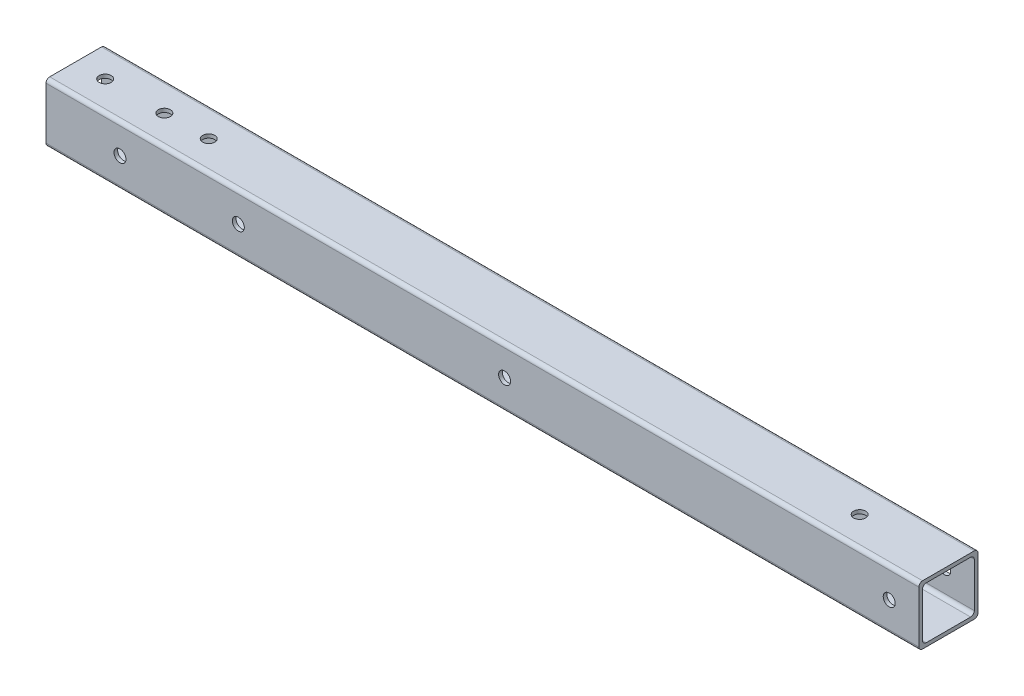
ISO-10303-21;
HEADER;
FILE_DESCRIPTION(('STEP AP214'),'2;1');
FILE_NAME('part.step','',(''),(''),'','','');
FILE_SCHEMA(('AUTOMOTIVE_DESIGN { 1 0 10303 214 1 1 1 1 }'));
ENDSEC;
DATA;
#1=APPLICATION_CONTEXT('core data for automotive mechanical design processes');
#2=APPLICATION_PROTOCOL_DEFINITION('international standard','automotive_design',2000,#1);
#3=PRODUCT_CONTEXT('',#1,'mechanical');
#4=PRODUCT('Part','Part','',(#3));
#5=PRODUCT_RELATED_PRODUCT_CATEGORY('part','',(#4));
#6=PRODUCT_DEFINITION_FORMATION('','',#4);
#7=PRODUCT_DEFINITION_CONTEXT('part definition',#1,'design');
#8=PRODUCT_DEFINITION('design','',#6,#7);
#9=PRODUCT_DEFINITION_SHAPE('','',#8);
#10=(LENGTH_UNIT() NAMED_UNIT(*) SI_UNIT(.MILLI.,.METRE.));
#11=(NAMED_UNIT(*) PLANE_ANGLE_UNIT() SI_UNIT($,.RADIAN.));
#12=(NAMED_UNIT(*) SI_UNIT($,.STERADIAN.) SOLID_ANGLE_UNIT());
#13=UNCERTAINTY_MEASURE_WITH_UNIT(LENGTH_MEASURE(1.E-05),#10,'distance_accuracy_value','');
#14=(GEOMETRIC_REPRESENTATION_CONTEXT(3) GLOBAL_UNCERTAINTY_ASSIGNED_CONTEXT((#13)) GLOBAL_UNIT_ASSIGNED_CONTEXT((#10,
#11,#12)) REPRESENTATION_CONTEXT('',''));
#15=CARTESIAN_POINT('',(0.,0.,0.));
#16=DIRECTION('',(0.,0.,1.));
#17=DIRECTION('',(1.,0.,0.));
#18=AXIS2_PLACEMENT_3D('',#15,#16,#17);
#19=CARTESIAN_POINT('',(0.,101.6,0.));
#20=DIRECTION('',(-1.,0.,0.));
#21=DIRECTION('',(0.,0.,1.));
#22=AXIS2_PLACEMENT_3D('',#19,#20,#21);
#23=PLANE('',#22);
#24=DIRECTION('',(0.,0.,1.));
#25=VECTOR('',#24,1.);
#26=CARTESIAN_POINT('',(0.,95.25,6.35000000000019));
#27=LINE('',#26,#25);
#28=CARTESIAN_POINT('',(0.,95.25,12.7000000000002));
#29=VERTEX_POINT('',#28);
#30=CARTESIAN_POINT('',(0.,95.25,88.9000000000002));
#31=VERTEX_POINT('',#30);
#32=EDGE_CURVE('E169',#29,#31,#27,.T.);
#33=ORIENTED_EDGE('',*,*,#32,.F.);
#34=CARTESIAN_POINT('',(0.,88.9,12.7000000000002));
#35=DIRECTION('',(-1.,0.,0.));
#36=DIRECTION('',(0.,0.,1.));
#37=AXIS2_PLACEMENT_3D('',#34,#35,#36);
#38=CIRCLE('',#37,6.35);
#39=CARTESIAN_POINT('',(0.,88.9,6.35000000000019));
#40=VERTEX_POINT('',#39);
#41=EDGE_CURVE('E179',#29,#40,#38,.T.);
#42=ORIENTED_EDGE('',*,*,#41,.T.);
#43=DIRECTION('',(0.,1.,0.));
#44=VECTOR('',#43,1.);
#45=CARTESIAN_POINT('',(0.,95.25,6.35000000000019));
#46=LINE('',#45,#44);
#47=CARTESIAN_POINT('',(0.,12.7,6.3500000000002));
#48=VERTEX_POINT('',#47);
#49=EDGE_CURVE('E276',#48,#40,#46,.T.);
#50=ORIENTED_EDGE('',*,*,#49,.F.);
#51=CARTESIAN_POINT('',(0.,12.7,12.7000000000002));
#52=DIRECTION('',(-1.,0.,0.));
#53=DIRECTION('',(0.,0.,1.));
#54=AXIS2_PLACEMENT_3D('',#51,#52,#53);
#55=CIRCLE('',#54,6.35);
#56=CARTESIAN_POINT('',(0.,6.35,12.7000000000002));
#57=VERTEX_POINT('',#56);
#58=EDGE_CURVE('E11',#48,#57,#55,.T.);
#59=ORIENTED_EDGE('',*,*,#58,.T.);
#60=DIRECTION('',(0.,0.,-1.));
#61=VECTOR('',#60,1.);
#62=CARTESIAN_POINT('',(0.,6.35,6.35000000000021));
#63=LINE('',#62,#61);
#64=CARTESIAN_POINT('',(0.,6.35,88.9000000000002));
#65=VERTEX_POINT('',#64);
#66=EDGE_CURVE('E289',#65,#57,#63,.T.);
#67=ORIENTED_EDGE('',*,*,#66,.F.);
#68=CARTESIAN_POINT('',(0.,12.7,88.9000000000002));
#69=DIRECTION('',(-1.,0.,0.));
#70=DIRECTION('',(0.,0.,1.));
#71=AXIS2_PLACEMENT_3D('',#68,#69,#70);
#72=CIRCLE('',#71,6.35);
#73=CARTESIAN_POINT('',(0.,12.7,95.2500000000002));
#74=VERTEX_POINT('',#73);
#75=EDGE_CURVE('E168',#65,#74,#72,.T.);
#76=ORIENTED_EDGE('',*,*,#75,.T.);
#77=DIRECTION('',(0.,-1.,0.));
#78=VECTOR('',#77,1.);
#79=CARTESIAN_POINT('',(0.,95.25,95.2500000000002));
#80=LINE('',#79,#78);
#81=CARTESIAN_POINT('',(0.,88.9,95.2500000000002));
#82=VERTEX_POINT('',#81);
#83=EDGE_CURVE('E152',#82,#74,#80,.T.);
#84=ORIENTED_EDGE('',*,*,#83,.F.);
#85=CARTESIAN_POINT('',(0.,88.9,88.9000000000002));
#86=DIRECTION('',(-1.,0.,0.));
#87=DIRECTION('',(0.,0.,1.));
#88=AXIS2_PLACEMENT_3D('',#85,#86,#87);
#89=CIRCLE('',#88,6.35);
#90=EDGE_CURVE('E164',#82,#31,#89,.T.);
#91=ORIENTED_EDGE('',*,*,#90,.T.);
#92=EDGE_LOOP('',(#33,#42,#50,#59,#67,#76,#84,#91));
#93=FACE_BOUND('',#92,.T.);
#94=DIRECTION('',(0.,-1.,0.));
#95=VECTOR('',#94,1.);
#96=CARTESIAN_POINT('',(0.,101.6,101.6));
#97=LINE('',#96,#95);
#98=CARTESIAN_POINT('',(0.,95.25,101.6));
#99=VERTEX_POINT('',#98);
#100=CARTESIAN_POINT('',(0.,6.34999999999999,101.6));
#101=VERTEX_POINT('',#100);
#102=EDGE_CURVE('E300',#99,#101,#97,.T.);
#103=ORIENTED_EDGE('',*,*,#102,.T.);
#104=CARTESIAN_POINT('',(0.,6.34999999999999,95.25));
#105=DIRECTION('',(-1.,0.,0.));
#106=DIRECTION('',(0.,0.,1.));
#107=AXIS2_PLACEMENT_3D('',#104,#105,#106);
#108=CIRCLE('',#107,6.35);
#109=CARTESIAN_POINT('',(0.,0.,95.25));
#110=VERTEX_POINT('',#109);
#111=EDGE_CURVE('E331',#101,#110,#108,.F.);
#112=ORIENTED_EDGE('',*,*,#111,.T.);
#113=DIRECTION('',(0.,0.,-1.));
#114=VECTOR('',#113,1.);
#115=CARTESIAN_POINT('',(0.,0.,0.));
#116=LINE('',#115,#114);
#117=CARTESIAN_POINT('',(0.,0.,6.35));
#118=VERTEX_POINT('',#117);
#119=EDGE_CURVE('E292',#110,#118,#116,.T.);
#120=ORIENTED_EDGE('',*,*,#119,.T.);
#121=CARTESIAN_POINT('',(0.,6.34999999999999,6.35));
#122=DIRECTION('',(-1.,0.,0.));
#123=DIRECTION('',(0.,0.,1.));
#124=AXIS2_PLACEMENT_3D('',#121,#122,#123);
#125=CIRCLE('',#124,6.35);
#126=CARTESIAN_POINT('',(0.,6.34999999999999,0.));
#127=VERTEX_POINT('',#126);
#128=EDGE_CURVE('E325',#118,#127,#125,.F.);
#129=ORIENTED_EDGE('',*,*,#128,.T.);
#130=DIRECTION('',(0.,-1.,0.));
#131=VECTOR('',#130,1.);
#132=CARTESIAN_POINT('',(0.,101.6,0.));
#133=LINE('',#132,#131);
#134=CARTESIAN_POINT('',(0.,95.25,0.));
#135=VERTEX_POINT('',#134);
#136=EDGE_CURVE('E159',#135,#127,#133,.T.);
#137=ORIENTED_EDGE('',*,*,#136,.F.);
#138=CARTESIAN_POINT('',(0.,95.25,6.35));
#139=DIRECTION('',(-1.,0.,0.));
#140=DIRECTION('',(0.,0.,1.));
#141=AXIS2_PLACEMENT_3D('',#138,#139,#140);
#142=CIRCLE('',#141,6.35);
#143=CARTESIAN_POINT('',(0.,101.6,6.35));
#144=VERTEX_POINT('',#143);
#145=EDGE_CURVE('E327',#135,#144,#142,.F.);
#146=ORIENTED_EDGE('',*,*,#145,.T.);
#147=DIRECTION('',(0.,0.,-1.));
#148=VECTOR('',#147,1.);
#149=CARTESIAN_POINT('',(0.,101.6,0.));
#150=LINE('',#149,#148);
#151=CARTESIAN_POINT('',(0.,101.6,95.25));
#152=VERTEX_POINT('',#151);
#153=EDGE_CURVE('E293',#152,#144,#150,.T.);
#154=ORIENTED_EDGE('',*,*,#153,.F.);
#155=CARTESIAN_POINT('',(0.,95.25,95.25));
#156=DIRECTION('',(-1.,0.,0.));
#157=DIRECTION('',(0.,0.,1.));
#158=AXIS2_PLACEMENT_3D('',#155,#156,#157);
#159=CIRCLE('',#158,6.35);
#160=EDGE_CURVE('E329',#152,#99,#159,.F.);
#161=ORIENTED_EDGE('',*,*,#160,.T.);
#162=EDGE_LOOP('',(#103,#112,#120,#129,#137,#146,#154,#161));
#163=FACE_BOUND('',#162,.T.);
#164=ADVANCED_FACE('F31',(#93,#163),#23,.F.);
#165=CARTESIAN_POINT('',(0.,101.6,0.));
#166=DIRECTION('',(0.,0.,1.));
#167=DIRECTION('',(1.,0.,0.));
#168=AXIS2_PLACEMENT_3D('',#165,#166,#167);
#169=PLANE('',#168);
#170=CARTESIAN_POINT('',(-1168.4,50.8,0.));
#171=DIRECTION('',(0.,0.,1.));
#172=DIRECTION('',(1.,0.,0.));
#173=AXIS2_PLACEMENT_3D('',#170,#171,#172);
#174=CIRCLE('',#173,10.31875);
#175=CARTESIAN_POINT('',(-1158.08125,50.8,0.));
#176=VERTEX_POINT('',#175);
#177=EDGE_CURVE('E463',#176,#176,#174,.T.);
#178=ORIENTED_EDGE('',*,*,#177,.T.);
#179=EDGE_LOOP('',(#178));
#180=FACE_BOUND('',#179,.T.);
#181=CARTESIAN_POINT('',(-711.2,50.7999999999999,0.));
#182=DIRECTION('',(0.,0.,1.));
#183=DIRECTION('',(1.,0.,0.));
#184=AXIS2_PLACEMENT_3D('',#181,#182,#183);
#185=CIRCLE('',#184,10.31875);
#186=CARTESIAN_POINT('',(-700.88125,50.7999999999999,0.));
#187=VERTEX_POINT('',#186);
#188=EDGE_CURVE('E217',#187,#187,#185,.T.);
#189=ORIENTED_EDGE('',*,*,#188,.T.);
#190=EDGE_LOOP('',(#189));
#191=FACE_BOUND('',#190,.T.);
#192=CARTESIAN_POINT('',(-50.8,50.8,0.));
#193=DIRECTION('',(0.,0.,1.));
#194=DIRECTION('',(1.,0.,0.));
#195=AXIS2_PLACEMENT_3D('',#192,#193,#194);
#196=CIRCLE('',#195,10.31875);
#197=CARTESIAN_POINT('',(-40.48125,50.8,0.));
#198=VERTEX_POINT('',#197);
#199=EDGE_CURVE('E213',#198,#198,#196,.T.);
#200=ORIENTED_EDGE('',*,*,#199,.T.);
#201=EDGE_LOOP('',(#200));
#202=FACE_BOUND('',#201,.T.);
#203=CARTESIAN_POINT('',(-1371.6,50.8,0.));
#204=DIRECTION('',(0.,0.,1.));
#205=DIRECTION('',(1.,0.,0.));
#206=AXIS2_PLACEMENT_3D('',#203,#204,#205);
#207=CIRCLE('',#206,10.31875);
#208=CARTESIAN_POINT('',(-1361.28125,50.8,0.));
#209=VERTEX_POINT('',#208);
#210=EDGE_CURVE('E209',#209,#209,#207,.T.);
#211=ORIENTED_EDGE('',*,*,#210,.T.);
#212=EDGE_LOOP('',(#211));
#213=FACE_BOUND('',#212,.T.);
#214=DIRECTION('',(0.,-1.,0.));
#215=VECTOR('',#214,1.);
#216=CARTESIAN_POINT('',(-1498.6,101.6,1.83519508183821E-13));
#217=LINE('',#216,#215);
#218=CARTESIAN_POINT('',(-1498.6,95.25,1.83519508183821E-13));
#219=VERTEX_POINT('',#218);
#220=CARTESIAN_POINT('',(-1498.6,6.34999999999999,1.83519508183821E-13));
#221=VERTEX_POINT('',#220);
#222=EDGE_CURVE('E310',#219,#221,#217,.T.);
#223=ORIENTED_EDGE('',*,*,#222,.F.);
#224=DIRECTION('',(-1.,0.,0.));
#225=VECTOR('',#224,1.);
#226=CARTESIAN_POINT('',(0.,95.25,0.));
#227=LINE('',#226,#225);
#228=EDGE_CURVE('E359',#219,#135,#227,.F.);
#229=ORIENTED_EDGE('',*,*,#228,.T.);
#230=ORIENTED_EDGE('',*,*,#136,.T.);
#231=DIRECTION('',(-1.,0.,0.));
#232=VECTOR('',#231,1.);
#233=CARTESIAN_POINT('',(-1498.6,6.34999999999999,1.83519508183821E-13));
#234=LINE('',#233,#232);
#235=EDGE_CURVE('E357',#127,#221,#234,.T.);
#236=ORIENTED_EDGE('',*,*,#235,.T.);
#237=EDGE_LOOP('',(#223,#229,#230,#236));
#238=FACE_BOUND('',#237,.T.);
#239=ADVANCED_FACE('F385',(#180,#191,#202,#213,#238),#169,.F.);
#240=CARTESIAN_POINT('',(-1498.6,101.6,1.83519508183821E-13));
#241=DIRECTION('',(1.,0.,0.));
#242=DIRECTION('',(0.,0.,-1.));
#243=AXIS2_PLACEMENT_3D('',#240,#241,#242);
#244=PLANE('',#243);
#245=DIRECTION('',(0.,0.,1.));
#246=VECTOR('',#245,1.);
#247=CARTESIAN_POINT('',(-1498.6,6.35,6.35000000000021));
#248=LINE('',#247,#246);
#249=CARTESIAN_POINT('',(-1498.6,6.35,12.7000000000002));
#250=VERTEX_POINT('',#249);
#251=CARTESIAN_POINT('',(-1498.6,6.35,88.9000000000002));
#252=VERTEX_POINT('',#251);
#253=EDGE_CURVE('E282',#250,#252,#248,.T.);
#254=ORIENTED_EDGE('',*,*,#253,.F.);
#255=CARTESIAN_POINT('',(-1498.6,12.7,12.7000000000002));
#256=DIRECTION('',(1.,0.,0.));
#257=DIRECTION('',(0.,0.,-1.));
#258=AXIS2_PLACEMENT_3D('',#255,#256,#257);
#259=CIRCLE('',#258,6.35);
#260=CARTESIAN_POINT('',(-1498.6,12.7,6.3500000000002));
#261=VERTEX_POINT('',#260);
#262=EDGE_CURVE('E40',#250,#261,#259,.T.);
#263=ORIENTED_EDGE('',*,*,#262,.T.);
#264=DIRECTION('',(0.,-1.,0.));
#265=VECTOR('',#264,1.);
#266=CARTESIAN_POINT('',(-1498.6,95.25,6.35000000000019));
#267=LINE('',#266,#265);
#268=CARTESIAN_POINT('',(-1498.6,88.9,6.35000000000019));
#269=VERTEX_POINT('',#268);
#270=EDGE_CURVE('E279',#269,#261,#267,.T.);
#271=ORIENTED_EDGE('',*,*,#270,.F.);
#272=CARTESIAN_POINT('',(-1498.6,88.9,12.7000000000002));
#273=DIRECTION('',(1.,0.,0.));
#274=DIRECTION('',(0.,0.,-1.));
#275=AXIS2_PLACEMENT_3D('',#272,#273,#274);
#276=CIRCLE('',#275,6.35);
#277=CARTESIAN_POINT('',(-1498.6,95.25,12.7000000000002));
#278=VERTEX_POINT('',#277);
#279=EDGE_CURVE('E176',#269,#278,#276,.T.);
#280=ORIENTED_EDGE('',*,*,#279,.T.);
#281=DIRECTION('',(0.,0.,-1.));
#282=VECTOR('',#281,1.);
#283=CARTESIAN_POINT('',(-1498.6,95.25,6.35000000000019));
#284=LINE('',#283,#282);
#285=CARTESIAN_POINT('',(-1498.6,95.25,88.9000000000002));
#286=VERTEX_POINT('',#285);
#287=EDGE_CURVE('E286',#286,#278,#284,.T.);
#288=ORIENTED_EDGE('',*,*,#287,.F.);
#289=CARTESIAN_POINT('',(-1498.6,88.9,88.9000000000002));
#290=DIRECTION('',(1.,0.,0.));
#291=DIRECTION('',(0.,0.,-1.));
#292=AXIS2_PLACEMENT_3D('',#289,#290,#291);
#293=CIRCLE('',#292,6.35);
#294=CARTESIAN_POINT('',(-1498.6,88.9,95.2500000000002));
#295=VERTEX_POINT('',#294);
#296=EDGE_CURVE('E177',#286,#295,#293,.T.);
#297=ORIENTED_EDGE('',*,*,#296,.T.);
#298=DIRECTION('',(0.,1.,0.));
#299=VECTOR('',#298,1.);
#300=CARTESIAN_POINT('',(-1498.6,95.25,95.2500000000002));
#301=LINE('',#300,#299);
#302=CARTESIAN_POINT('',(-1498.6,12.7,95.2500000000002));
#303=VERTEX_POINT('',#302);
#304=EDGE_CURVE('E155',#303,#295,#301,.T.);
#305=ORIENTED_EDGE('',*,*,#304,.F.);
#306=CARTESIAN_POINT('',(-1498.6,12.7,88.9000000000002));
#307=DIRECTION('',(1.,0.,0.));
#308=DIRECTION('',(0.,0.,-1.));
#309=AXIS2_PLACEMENT_3D('',#306,#307,#308);
#310=CIRCLE('',#309,6.35);
#311=EDGE_CURVE('E361',#303,#252,#310,.T.);
#312=ORIENTED_EDGE('',*,*,#311,.T.);
#313=EDGE_LOOP('',(#254,#263,#271,#280,#288,#297,#305,#312));
#314=FACE_BOUND('',#313,.T.);
#315=DIRECTION('',(0.,0.,1.));
#316=VECTOR('',#315,1.);
#317=CARTESIAN_POINT('',(-1498.6,0.,1.83519508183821E-13));
#318=LINE('',#317,#316);
#319=CARTESIAN_POINT('',(-1498.6,0.,6.35000000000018));
#320=VERTEX_POINT('',#319);
#321=CARTESIAN_POINT('',(-1498.6,0.,95.2500000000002));
#322=VERTEX_POINT('',#321);
#323=EDGE_CURVE('E297',#320,#322,#318,.T.);
#324=ORIENTED_EDGE('',*,*,#323,.T.);
#325=CARTESIAN_POINT('',(-1498.6,6.34999999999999,95.2500000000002));
#326=DIRECTION('',(1.,0.,0.));
#327=DIRECTION('',(0.,0.,-1.));
#328=AXIS2_PLACEMENT_3D('',#325,#326,#327);
#329=CIRCLE('',#328,6.35);
#330=CARTESIAN_POINT('',(-1498.6,6.34999999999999,101.6));
#331=VERTEX_POINT('',#330);
#332=EDGE_CURVE('E341',#322,#331,#329,.F.);
#333=ORIENTED_EDGE('',*,*,#332,.T.);
#334=DIRECTION('',(0.,-1.,0.));
#335=VECTOR('',#334,1.);
#336=CARTESIAN_POINT('',(-1498.6,101.6,101.6));
#337=LINE('',#336,#335);
#338=CARTESIAN_POINT('',(-1498.6,95.25,101.6));
#339=VERTEX_POINT('',#338);
#340=EDGE_CURVE('E307',#339,#331,#337,.T.);
#341=ORIENTED_EDGE('',*,*,#340,.F.);
#342=CARTESIAN_POINT('',(-1498.6,95.25,95.2500000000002));
#343=DIRECTION('',(1.,0.,0.));
#344=DIRECTION('',(0.,0.,-1.));
#345=AXIS2_PLACEMENT_3D('',#342,#343,#344);
#346=CIRCLE('',#345,6.35);
#347=CARTESIAN_POINT('',(-1498.6,101.6,95.2500000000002));
#348=VERTEX_POINT('',#347);
#349=EDGE_CURVE('E339',#339,#348,#346,.F.);
#350=ORIENTED_EDGE('',*,*,#349,.T.);
#351=DIRECTION('',(0.,0.,1.));
#352=VECTOR('',#351,1.);
#353=CARTESIAN_POINT('',(-1498.6,101.6,1.83519508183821E-13));
#354=LINE('',#353,#352);
#355=CARTESIAN_POINT('',(-1498.6,101.6,6.35000000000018));
#356=VERTEX_POINT('',#355);
#357=EDGE_CURVE('E296',#356,#348,#354,.T.);
#358=ORIENTED_EDGE('',*,*,#357,.F.);
#359=CARTESIAN_POINT('',(-1498.6,95.25,6.35000000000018));
#360=DIRECTION('',(1.,0.,0.));
#361=DIRECTION('',(0.,0.,-1.));
#362=AXIS2_PLACEMENT_3D('',#359,#360,#361);
#363=CIRCLE('',#362,6.35);
#364=EDGE_CURVE('E56',#356,#219,#363,.F.);
#365=ORIENTED_EDGE('',*,*,#364,.T.);
#366=ORIENTED_EDGE('',*,*,#222,.T.);
#367=CARTESIAN_POINT('',(-1498.6,6.34999999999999,6.35000000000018));
#368=DIRECTION('',(1.,0.,0.));
#369=DIRECTION('',(0.,0.,-1.));
#370=AXIS2_PLACEMENT_3D('',#367,#368,#369);
#371=CIRCLE('',#370,6.35);
#372=EDGE_CURVE('E48',#221,#320,#371,.F.);
#373=ORIENTED_EDGE('',*,*,#372,.T.);
#374=EDGE_LOOP('',(#324,#333,#341,#350,#358,#365,#366,#373));
#375=FACE_BOUND('',#374,.T.);
#376=ADVANCED_FACE('F364',(#314,#375),#244,.F.);
#377=CARTESIAN_POINT('',(0.,101.6,101.6));
#378=DIRECTION('',(0.,0.,-1.));
#379=DIRECTION('',(-1.,0.,0.));
#380=AXIS2_PLACEMENT_3D('',#377,#378,#379);
#381=PLANE('',#380);
#382=CARTESIAN_POINT('',(-1168.4,50.8,101.6));
#383=DIRECTION('',(0.,0.,1.));
#384=DIRECTION('',(1.,0.,0.));
#385=AXIS2_PLACEMENT_3D('',#382,#383,#384);
#386=CIRCLE('',#385,10.31875);
#387=CARTESIAN_POINT('',(-1158.08125,50.8,101.6));
#388=VERTEX_POINT('',#387);
#389=EDGE_CURVE('E468',#388,#388,#386,.T.);
#390=ORIENTED_EDGE('',*,*,#389,.F.);
#391=EDGE_LOOP('',(#390));
#392=FACE_BOUND('',#391,.T.);
#393=CARTESIAN_POINT('',(-711.2,50.7999999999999,101.6));
#394=DIRECTION('',(0.,0.,1.));
#395=DIRECTION('',(1.,0.,0.));
#396=AXIS2_PLACEMENT_3D('',#393,#394,#395);
#397=CIRCLE('',#396,10.31875);
#398=CARTESIAN_POINT('',(-700.88125,50.7999999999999,101.6));
#399=VERTEX_POINT('',#398);
#400=EDGE_CURVE('E224',#399,#399,#397,.T.);
#401=ORIENTED_EDGE('',*,*,#400,.F.);
#402=EDGE_LOOP('',(#401));
#403=FACE_BOUND('',#402,.T.);
#404=CARTESIAN_POINT('',(-50.8,50.8,101.6));
#405=DIRECTION('',(0.,0.,1.));
#406=DIRECTION('',(1.,0.,0.));
#407=AXIS2_PLACEMENT_3D('',#404,#405,#406);
#408=CIRCLE('',#407,10.31875);
#409=CARTESIAN_POINT('',(-40.48125,50.8,101.6));
#410=VERTEX_POINT('',#409);
#411=EDGE_CURVE('E221',#410,#410,#408,.T.);
#412=ORIENTED_EDGE('',*,*,#411,.F.);
#413=EDGE_LOOP('',(#412));
#414=FACE_BOUND('',#413,.T.);
#415=CARTESIAN_POINT('',(-1371.6,50.8,101.6));
#416=DIRECTION('',(0.,0.,1.));
#417=DIRECTION('',(1.,0.,0.));
#418=AXIS2_PLACEMENT_3D('',#415,#416,#417);
#419=CIRCLE('',#418,10.31875);
#420=CARTESIAN_POINT('',(-1361.28125,50.8,101.6));
#421=VERTEX_POINT('',#420);
#422=EDGE_CURVE('E240',#421,#421,#419,.T.);
#423=ORIENTED_EDGE('',*,*,#422,.F.);
#424=EDGE_LOOP('',(#423));
#425=FACE_BOUND('',#424,.T.);
#426=ORIENTED_EDGE('',*,*,#340,.T.);
#427=DIRECTION('',(1.,0.,0.));
#428=VECTOR('',#427,1.);
#429=CARTESIAN_POINT('',(0.,6.34999999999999,101.6));
#430=LINE('',#429,#428);
#431=EDGE_CURVE('E322',#331,#101,#430,.T.);
#432=ORIENTED_EDGE('',*,*,#431,.T.);
#433=ORIENTED_EDGE('',*,*,#102,.F.);
#434=DIRECTION('',(1.,0.,0.));
#435=VECTOR('',#434,1.);
#436=CARTESIAN_POINT('',(0.,95.25,101.6));
#437=LINE('',#436,#435);
#438=EDGE_CURVE('E320',#99,#339,#437,.F.);
#439=ORIENTED_EDGE('',*,*,#438,.T.);
#440=EDGE_LOOP('',(#426,#432,#433,#439));
#441=FACE_BOUND('',#440,.T.);
#442=ADVANCED_FACE('F394',(#392,#403,#414,#425,#441),#381,.F.);
#443=CARTESIAN_POINT('',(0.,101.6,0.));
#444=DIRECTION('',(0.,-1.,0.));
#445=DIRECTION('',(0.,0.,-1.));
#446=AXIS2_PLACEMENT_3D('',#443,#444,#445);
#447=PLANE('',#446);
#448=CARTESIAN_POINT('',(-152.4,101.6,50.8));
#449=DIRECTION('',(0.,-1.,0.));
#450=DIRECTION('',(0.,0.,-1.));
#451=AXIS2_PLACEMENT_3D('',#448,#449,#450);
#452=CIRCLE('',#451,10.31875);
#453=CARTESIAN_POINT('',(-152.4,101.6,40.48125));
#454=VERTEX_POINT('',#453);
#455=EDGE_CURVE('E204',#454,#454,#452,.T.);
#456=ORIENTED_EDGE('',*,*,#455,.T.);
#457=EDGE_LOOP('',(#456));
#458=FACE_BOUND('',#457,.T.);
#459=CARTESIAN_POINT('',(-1270.,101.6,50.8));
#460=DIRECTION('',(0.,-1.,0.));
#461=DIRECTION('',(0.,0.,-1.));
#462=AXIS2_PLACEMENT_3D('',#459,#460,#461);
#463=CIRCLE('',#462,10.31875);
#464=CARTESIAN_POINT('',(-1270.,101.6,40.48125));
#465=VERTEX_POINT('',#464);
#466=EDGE_CURVE('E199',#465,#465,#463,.T.);
#467=ORIENTED_EDGE('',*,*,#466,.T.);
#468=EDGE_LOOP('',(#467));
#469=FACE_BOUND('',#468,.T.);
#470=CARTESIAN_POINT('',(-1346.2,101.6,50.8));
#471=DIRECTION('',(0.,-1.,0.));
#472=DIRECTION('',(0.,0.,-1.));
#473=AXIS2_PLACEMENT_3D('',#470,#471,#472);
#474=CIRCLE('',#473,10.31875);
#475=CARTESIAN_POINT('',(-1346.2,101.6,40.48125));
#476=VERTEX_POINT('',#475);
#477=EDGE_CURVE('E194',#476,#476,#474,.T.);
#478=ORIENTED_EDGE('',*,*,#477,.T.);
#479=EDGE_LOOP('',(#478));
#480=FACE_BOUND('',#479,.T.);
#481=CARTESIAN_POINT('',(-1447.8,101.6,50.8));
#482=DIRECTION('',(0.,-1.,0.));
#483=DIRECTION('',(0.,0.,-1.));
#484=AXIS2_PLACEMENT_3D('',#481,#482,#483);
#485=CIRCLE('',#484,10.31875);
#486=CARTESIAN_POINT('',(-1447.8,101.6,40.48125));
#487=VERTEX_POINT('',#486);
#488=EDGE_CURVE('E189',#487,#487,#485,.T.);
#489=ORIENTED_EDGE('',*,*,#488,.T.);
#490=EDGE_LOOP('',(#489));
#491=FACE_BOUND('',#490,.T.);
#492=ORIENTED_EDGE('',*,*,#357,.T.);
#493=DIRECTION('',(1.,0.,0.));
#494=VECTOR('',#493,1.);
#495=CARTESIAN_POINT('',(0.,101.6,95.25));
#496=LINE('',#495,#494);
#497=EDGE_CURVE('E346',#348,#152,#496,.T.);
#498=ORIENTED_EDGE('',*,*,#497,.T.);
#499=ORIENTED_EDGE('',*,*,#153,.T.);
#500=DIRECTION('',(-1.,0.,0.));
#501=VECTOR('',#500,1.);
#502=CARTESIAN_POINT('',(0.,101.6,6.35));
#503=LINE('',#502,#501);
#504=EDGE_CURVE('E343',#144,#356,#503,.T.);
#505=ORIENTED_EDGE('',*,*,#504,.T.);
#506=EDGE_LOOP('',(#492,#498,#499,#505));
#507=FACE_BOUND('',#506,.T.);
#508=ADVANCED_FACE('F397',(#458,#469,#480,#491,#507),#447,.F.);
#509=CARTESIAN_POINT('',(0.,0.,0.));
#510=DIRECTION('',(0.,-1.,0.));
#511=DIRECTION('',(0.,0.,-1.));
#512=AXIS2_PLACEMENT_3D('',#509,#510,#511);
#513=PLANE('',#512);
#514=CARTESIAN_POINT('',(-152.4,0.,50.8));
#515=DIRECTION('',(0.,-1.,0.));
#516=DIRECTION('',(0.,0.,-1.));
#517=AXIS2_PLACEMENT_3D('',#514,#515,#516);
#518=CIRCLE('',#517,10.31875);
#519=CARTESIAN_POINT('',(-152.4,0.,40.48125));
#520=VERTEX_POINT('',#519);
#521=EDGE_CURVE('E247',#520,#520,#518,.T.);
#522=ORIENTED_EDGE('',*,*,#521,.F.);
#523=EDGE_LOOP('',(#522));
#524=FACE_BOUND('',#523,.T.);
#525=CARTESIAN_POINT('',(-1270.,0.,50.8));
#526=DIRECTION('',(0.,-1.,0.));
#527=DIRECTION('',(0.,0.,-1.));
#528=AXIS2_PLACEMENT_3D('',#525,#526,#527);
#529=CIRCLE('',#528,10.31875);
#530=CARTESIAN_POINT('',(-1270.,0.,40.48125));
#531=VERTEX_POINT('',#530);
#532=EDGE_CURVE('E254',#531,#531,#529,.T.);
#533=ORIENTED_EDGE('',*,*,#532,.F.);
#534=EDGE_LOOP('',(#533));
#535=FACE_BOUND('',#534,.T.);
#536=CARTESIAN_POINT('',(-1346.2,0.,50.8));
#537=DIRECTION('',(0.,-1.,0.));
#538=DIRECTION('',(0.,0.,-1.));
#539=AXIS2_PLACEMENT_3D('',#536,#537,#538);
#540=CIRCLE('',#539,10.31875);
#541=CARTESIAN_POINT('',(-1346.2,0.,40.48125));
#542=VERTEX_POINT('',#541);
#543=EDGE_CURVE('E261',#542,#542,#540,.T.);
#544=ORIENTED_EDGE('',*,*,#543,.F.);
#545=EDGE_LOOP('',(#544));
#546=FACE_BOUND('',#545,.T.);
#547=CARTESIAN_POINT('',(-1447.8,0.,50.8));
#548=DIRECTION('',(0.,-1.,0.));
#549=DIRECTION('',(0.,0.,-1.));
#550=AXIS2_PLACEMENT_3D('',#547,#548,#549);
#551=CIRCLE('',#550,10.31875);
#552=CARTESIAN_POINT('',(-1447.8,0.,40.48125));
#553=VERTEX_POINT('',#552);
#554=EDGE_CURVE('E268',#553,#553,#551,.T.);
#555=ORIENTED_EDGE('',*,*,#554,.F.);
#556=EDGE_LOOP('',(#555));
#557=FACE_BOUND('',#556,.T.);
#558=ORIENTED_EDGE('',*,*,#119,.F.);
#559=DIRECTION('',(1.,0.,0.));
#560=VECTOR('',#559,1.);
#561=CARTESIAN_POINT('',(-1498.6,0.,95.2500000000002));
#562=LINE('',#561,#560);
#563=EDGE_CURVE('E335',#110,#322,#562,.F.);
#564=ORIENTED_EDGE('',*,*,#563,.T.);
#565=ORIENTED_EDGE('',*,*,#323,.F.);
#566=DIRECTION('',(-1.,0.,0.));
#567=VECTOR('',#566,1.);
#568=CARTESIAN_POINT('',(0.,0.,6.35));
#569=LINE('',#568,#567);
#570=EDGE_CURVE('E333',#320,#118,#569,.F.);
#571=ORIENTED_EDGE('',*,*,#570,.T.);
#572=EDGE_LOOP('',(#558,#564,#565,#571));
#573=FACE_BOUND('',#572,.T.);
#574=ADVANCED_FACE('F399',(#524,#535,#546,#557,#573),#513,.T.);
#575=CARTESIAN_POINT('',(0.000999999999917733,95.25,6.35000000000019));
#576=DIRECTION('',(0.,0.,-1.));
#577=DIRECTION('',(0.,1.,0.));
#578=AXIS2_PLACEMENT_3D('',#575,#576,#577);
#579=PLANE('',#578);
#580=CARTESIAN_POINT('',(-1168.4,50.8,6.3500000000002));
#581=DIRECTION('',(0.,0.,-1.));
#582=DIRECTION('',(0.,1.,0.));
#583=AXIS2_PLACEMENT_3D('',#580,#581,#582);
#584=CIRCLE('',#583,10.31875);
#585=CARTESIAN_POINT('',(-1168.4,61.11875,6.3500000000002));
#586=VERTEX_POINT('',#585);
#587=EDGE_CURVE('E229',#586,#586,#584,.T.);
#588=ORIENTED_EDGE('',*,*,#587,.T.);
#589=EDGE_LOOP('',(#588));
#590=FACE_BOUND('',#589,.T.);
#591=CARTESIAN_POINT('',(-711.2,50.7999999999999,6.3500000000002));
#592=DIRECTION('',(0.,0.,-1.));
#593=DIRECTION('',(0.,1.,0.));
#594=AXIS2_PLACEMENT_3D('',#591,#592,#593);
#595=CIRCLE('',#594,10.31875);
#596=CARTESIAN_POINT('',(-711.2,61.1187499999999,6.3500000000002));
#597=VERTEX_POINT('',#596);
#598=EDGE_CURVE('E216',#597,#597,#595,.T.);
#599=ORIENTED_EDGE('',*,*,#598,.T.);
#600=EDGE_LOOP('',(#599));
#601=FACE_BOUND('',#600,.T.);
#602=CARTESIAN_POINT('',(-50.8,50.8,6.3500000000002));
#603=DIRECTION('',(0.,0.,-1.));
#604=DIRECTION('',(0.,1.,0.));
#605=AXIS2_PLACEMENT_3D('',#602,#603,#604);
#606=CIRCLE('',#605,10.31875);
#607=CARTESIAN_POINT('',(-50.8,61.11875,6.3500000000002));
#608=VERTEX_POINT('',#607);
#609=EDGE_CURVE('E212',#608,#608,#606,.T.);
#610=ORIENTED_EDGE('',*,*,#609,.T.);
#611=EDGE_LOOP('',(#610));
#612=FACE_BOUND('',#611,.T.);
#613=CARTESIAN_POINT('',(-1371.6,50.8,6.3500000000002));
#614=DIRECTION('',(0.,0.,-1.));
#615=DIRECTION('',(0.,1.,0.));
#616=AXIS2_PLACEMENT_3D('',#613,#614,#615);
#617=CIRCLE('',#616,10.31875);
#618=CARTESIAN_POINT('',(-1371.6,61.11875,6.3500000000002));
#619=VERTEX_POINT('',#618);
#620=EDGE_CURVE('E208',#619,#619,#617,.T.);
#621=ORIENTED_EDGE('',*,*,#620,.T.);
#622=EDGE_LOOP('',(#621));
#623=FACE_BOUND('',#622,.T.);
#624=ORIENTED_EDGE('',*,*,#49,.T.);
#625=DIRECTION('',(-1.,0.,0.));
#626=VECTOR('',#625,1.);
#627=CARTESIAN_POINT('',(-1498.6,88.9,6.35000000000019));
#628=LINE('',#627,#626);
#629=EDGE_CURVE('E354',#40,#269,#628,.T.);
#630=ORIENTED_EDGE('',*,*,#629,.T.);
#631=ORIENTED_EDGE('',*,*,#270,.T.);
#632=DIRECTION('',(-1.,0.,0.));
#633=VECTOR('',#632,1.);
#634=CARTESIAN_POINT('',(0.,12.7,6.3500000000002));
#635=LINE('',#634,#633);
#636=EDGE_CURVE('E352',#261,#48,#635,.F.);
#637=ORIENTED_EDGE('',*,*,#636,.T.);
#638=EDGE_LOOP('',(#624,#630,#631,#637));
#639=FACE_BOUND('',#638,.T.);
#640=ADVANCED_FACE('F402',(#590,#601,#612,#623,#639),#579,.F.);
#641=CARTESIAN_POINT('',(0.000999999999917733,95.25,6.35000000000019));
#642=DIRECTION('',(0.,1.,0.));
#643=DIRECTION('',(0.,0.,1.));
#644=AXIS2_PLACEMENT_3D('',#641,#642,#643);
#645=PLANE('',#644);
#646=CARTESIAN_POINT('',(-152.4,95.25,50.8));
#647=DIRECTION('',(0.,1.,0.));
#648=DIRECTION('',(0.,0.,1.));
#649=AXIS2_PLACEMENT_3D('',#646,#647,#648);
#650=CIRCLE('',#649,10.31875);
#651=CARTESIAN_POINT('',(-152.4,95.25,61.11875));
#652=VERTEX_POINT('',#651);
#653=EDGE_CURVE('E203',#652,#652,#650,.T.);
#654=ORIENTED_EDGE('',*,*,#653,.T.);
#655=EDGE_LOOP('',(#654));
#656=FACE_BOUND('',#655,.T.);
#657=CARTESIAN_POINT('',(-1270.,95.25,50.8));
#658=DIRECTION('',(0.,1.,0.));
#659=DIRECTION('',(0.,0.,1.));
#660=AXIS2_PLACEMENT_3D('',#657,#658,#659);
#661=CIRCLE('',#660,10.31875);
#662=CARTESIAN_POINT('',(-1270.,95.25,61.11875));
#663=VERTEX_POINT('',#662);
#664=EDGE_CURVE('E198',#663,#663,#661,.T.);
#665=ORIENTED_EDGE('',*,*,#664,.T.);
#666=EDGE_LOOP('',(#665));
#667=FACE_BOUND('',#666,.T.);
#668=CARTESIAN_POINT('',(-1346.2,95.25,50.8));
#669=DIRECTION('',(0.,1.,0.));
#670=DIRECTION('',(0.,0.,1.));
#671=AXIS2_PLACEMENT_3D('',#668,#669,#670);
#672=CIRCLE('',#671,10.31875);
#673=CARTESIAN_POINT('',(-1346.2,95.25,61.11875));
#674=VERTEX_POINT('',#673);
#675=EDGE_CURVE('E193',#674,#674,#672,.T.);
#676=ORIENTED_EDGE('',*,*,#675,.T.);
#677=EDGE_LOOP('',(#676));
#678=FACE_BOUND('',#677,.T.);
#679=CARTESIAN_POINT('',(-1447.8,95.25,50.8));
#680=DIRECTION('',(0.,1.,0.));
#681=DIRECTION('',(0.,0.,1.));
#682=AXIS2_PLACEMENT_3D('',#679,#680,#681);
#683=CIRCLE('',#682,10.31875);
#684=CARTESIAN_POINT('',(-1447.8,95.25,61.11875));
#685=VERTEX_POINT('',#684);
#686=EDGE_CURVE('E170',#685,#685,#683,.T.);
#687=ORIENTED_EDGE('',*,*,#686,.T.);
#688=EDGE_LOOP('',(#687));
#689=FACE_BOUND('',#688,.T.);
#690=ORIENTED_EDGE('',*,*,#32,.T.);
#691=DIRECTION('',(-1.,0.,0.));
#692=VECTOR('',#691,1.);
#693=CARTESIAN_POINT('',(-1498.6,95.25,88.9000000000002));
#694=LINE('',#693,#692);
#695=EDGE_CURVE('E175',#31,#286,#694,.T.);
#696=ORIENTED_EDGE('',*,*,#695,.T.);
#697=ORIENTED_EDGE('',*,*,#287,.T.);
#698=DIRECTION('',(-1.,0.,0.));
#699=VECTOR('',#698,1.);
#700=CARTESIAN_POINT('',(0.,95.25,12.7000000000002));
#701=LINE('',#700,#699);
#702=EDGE_CURVE('E349',#278,#29,#701,.F.);
#703=ORIENTED_EDGE('',*,*,#702,.T.);
#704=EDGE_LOOP('',(#690,#696,#697,#703));
#705=FACE_BOUND('',#704,.T.);
#706=ADVANCED_FACE('F408',(#656,#667,#678,#689,#705),#645,.F.);
#707=CARTESIAN_POINT('',(0.000999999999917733,95.25,95.2500000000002));
#708=DIRECTION('',(0.,0.,1.));
#709=DIRECTION('',(0.,-1.,0.));
#710=AXIS2_PLACEMENT_3D('',#707,#708,#709);
#711=PLANE('',#710);
#712=CARTESIAN_POINT('',(-1168.4,50.8,95.2500000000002));
#713=DIRECTION('',(0.,0.,1.));
#714=DIRECTION('',(0.,-1.,0.));
#715=AXIS2_PLACEMENT_3D('',#712,#713,#714);
#716=CIRCLE('',#715,10.31875);
#717=CARTESIAN_POINT('',(-1168.4,40.48125,95.2500000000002));
#718=VERTEX_POINT('',#717);
#719=EDGE_CURVE('E35',#718,#718,#716,.T.);
#720=ORIENTED_EDGE('',*,*,#719,.T.);
#721=EDGE_LOOP('',(#720));
#722=FACE_BOUND('',#721,.T.);
#723=CARTESIAN_POINT('',(-711.2,50.7999999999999,95.2500000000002));
#724=DIRECTION('',(0.,0.,1.));
#725=DIRECTION('',(0.,-1.,0.));
#726=AXIS2_PLACEMENT_3D('',#723,#724,#725);
#727=CIRCLE('',#726,10.31875);
#728=CARTESIAN_POINT('',(-711.2,40.4812499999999,95.2500000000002));
#729=VERTEX_POINT('',#728);
#730=EDGE_CURVE('E214',#729,#729,#727,.T.);
#731=ORIENTED_EDGE('',*,*,#730,.T.);
#732=EDGE_LOOP('',(#731));
#733=FACE_BOUND('',#732,.T.);
#734=CARTESIAN_POINT('',(-50.8,50.8,95.2500000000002));
#735=DIRECTION('',(0.,0.,1.));
#736=DIRECTION('',(0.,-1.,0.));
#737=AXIS2_PLACEMENT_3D('',#734,#735,#736);
#738=CIRCLE('',#737,10.31875);
#739=CARTESIAN_POINT('',(-50.8,40.48125,95.2500000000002));
#740=VERTEX_POINT('',#739);
#741=EDGE_CURVE('E210',#740,#740,#738,.T.);
#742=ORIENTED_EDGE('',*,*,#741,.T.);
#743=EDGE_LOOP('',(#742));
#744=FACE_BOUND('',#743,.T.);
#745=CARTESIAN_POINT('',(-1371.6,50.8,95.2500000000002));
#746=DIRECTION('',(0.,0.,1.));
#747=DIRECTION('',(0.,-1.,0.));
#748=AXIS2_PLACEMENT_3D('',#745,#746,#747);
#749=CIRCLE('',#748,10.31875);
#750=CARTESIAN_POINT('',(-1371.6,40.48125,95.2500000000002));
#751=VERTEX_POINT('',#750);
#752=EDGE_CURVE('E205',#751,#751,#749,.T.);
#753=ORIENTED_EDGE('',*,*,#752,.T.);
#754=EDGE_LOOP('',(#753));
#755=FACE_BOUND('',#754,.T.);
#756=ORIENTED_EDGE('',*,*,#83,.T.);
#757=DIRECTION('',(-1.,0.,0.));
#758=VECTOR('',#757,1.);
#759=CARTESIAN_POINT('',(-1498.6,12.7,95.2500000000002));
#760=LINE('',#759,#758);
#761=EDGE_CURVE('E158',#74,#303,#760,.T.);
#762=ORIENTED_EDGE('',*,*,#761,.T.);
#763=ORIENTED_EDGE('',*,*,#304,.T.);
#764=DIRECTION('',(-1.,0.,0.));
#765=VECTOR('',#764,1.);
#766=CARTESIAN_POINT('',(0.,88.9,95.2500000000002));
#767=LINE('',#766,#765);
#768=EDGE_CURVE('E148',#295,#82,#767,.F.);
#769=ORIENTED_EDGE('',*,*,#768,.T.);
#770=EDGE_LOOP('',(#756,#762,#763,#769));
#771=FACE_BOUND('',#770,.T.);
#772=ADVANCED_FACE('F150',(#722,#733,#744,#755,#771),#711,.F.);
#773=CARTESIAN_POINT('',(0.000999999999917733,6.35,6.35000000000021));
#774=DIRECTION('',(0.,-1.,0.));
#775=DIRECTION('',(0.,0.,-1.));
#776=AXIS2_PLACEMENT_3D('',#773,#774,#775);
#777=PLANE('',#776);
#778=CARTESIAN_POINT('',(-152.4,6.34999999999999,50.8));
#779=DIRECTION('',(0.,-1.,0.));
#780=DIRECTION('',(0.,0.,-1.));
#781=AXIS2_PLACEMENT_3D('',#778,#779,#780);
#782=CIRCLE('',#781,10.31875);
#783=CARTESIAN_POINT('',(-152.4,6.34999999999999,40.48125));
#784=VERTEX_POINT('',#783);
#785=EDGE_CURVE('E200',#784,#784,#782,.T.);
#786=ORIENTED_EDGE('',*,*,#785,.T.);
#787=EDGE_LOOP('',(#786));
#788=FACE_BOUND('',#787,.T.);
#789=CARTESIAN_POINT('',(-1270.,6.34999999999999,50.8));
#790=DIRECTION('',(0.,-1.,0.));
#791=DIRECTION('',(0.,0.,-1.));
#792=AXIS2_PLACEMENT_3D('',#789,#790,#791);
#793=CIRCLE('',#792,10.31875);
#794=CARTESIAN_POINT('',(-1270.,6.34999999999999,40.48125));
#795=VERTEX_POINT('',#794);
#796=EDGE_CURVE('E195',#795,#795,#793,.T.);
#797=ORIENTED_EDGE('',*,*,#796,.T.);
#798=EDGE_LOOP('',(#797));
#799=FACE_BOUND('',#798,.T.);
#800=CARTESIAN_POINT('',(-1346.2,6.34999999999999,50.8));
#801=DIRECTION('',(0.,-1.,0.));
#802=DIRECTION('',(0.,0.,-1.));
#803=AXIS2_PLACEMENT_3D('',#800,#801,#802);
#804=CIRCLE('',#803,10.31875);
#805=CARTESIAN_POINT('',(-1346.2,6.34999999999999,40.48125));
#806=VERTEX_POINT('',#805);
#807=EDGE_CURVE('E190',#806,#806,#804,.T.);
#808=ORIENTED_EDGE('',*,*,#807,.T.);
#809=EDGE_LOOP('',(#808));
#810=FACE_BOUND('',#809,.T.);
#811=CARTESIAN_POINT('',(-1447.8,6.34999999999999,50.8));
#812=DIRECTION('',(0.,-1.,0.));
#813=DIRECTION('',(0.,0.,-1.));
#814=AXIS2_PLACEMENT_3D('',#811,#812,#813);
#815=CIRCLE('',#814,10.31875);
#816=CARTESIAN_POINT('',(-1447.8,6.34999999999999,40.48125));
#817=VERTEX_POINT('',#816);
#818=EDGE_CURVE('E186',#817,#817,#815,.T.);
#819=ORIENTED_EDGE('',*,*,#818,.T.);
#820=EDGE_LOOP('',(#819));
#821=FACE_BOUND('',#820,.T.);
#822=ORIENTED_EDGE('',*,*,#253,.T.);
#823=DIRECTION('',(-1.,0.,0.));
#824=VECTOR('',#823,1.);
#825=CARTESIAN_POINT('',(0.,6.35,88.9000000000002));
#826=LINE('',#825,#824);
#827=EDGE_CURVE('E318',#252,#65,#826,.F.);
#828=ORIENTED_EDGE('',*,*,#827,.T.);
#829=ORIENTED_EDGE('',*,*,#66,.T.);
#830=DIRECTION('',(-1.,0.,0.));
#831=VECTOR('',#830,1.);
#832=CARTESIAN_POINT('',(-1498.6,6.35,12.7000000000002));
#833=LINE('',#832,#831);
#834=EDGE_CURVE('E315',#57,#250,#833,.T.);
#835=ORIENTED_EDGE('',*,*,#834,.T.);
#836=EDGE_LOOP('',(#822,#828,#829,#835));
#837=FACE_BOUND('',#836,.T.);
#838=ADVANCED_FACE('F368',(#788,#799,#810,#821,#837),#777,.F.);
#839=CARTESIAN_POINT('',(0.000999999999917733,12.7,88.9000000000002));
#840=DIRECTION('',(1.,0.,0.));
#841=DIRECTION('',(0.,0.,-1.));
#842=AXIS2_PLACEMENT_3D('',#839,#840,#841);
#843=CYLINDRICAL_SURFACE('',#842,6.35);
#844=ORIENTED_EDGE('',*,*,#75,.F.);
#845=ORIENTED_EDGE('',*,*,#827,.F.);
#846=ORIENTED_EDGE('',*,*,#311,.F.);
#847=ORIENTED_EDGE('',*,*,#761,.F.);
#848=EDGE_LOOP('',(#844,#845,#846,#847));
#849=FACE_BOUND('',#848,.T.);
#850=ADVANCED_FACE('F370',(#849),#843,.F.);
#851=CARTESIAN_POINT('',(0.,6.34999999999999,95.25));
#852=DIRECTION('',(-1.,0.,0.));
#853=DIRECTION('',(0.,0.,1.));
#854=AXIS2_PLACEMENT_3D('',#851,#852,#853);
#855=CYLINDRICAL_SURFACE('',#854,6.35);
#856=ORIENTED_EDGE('',*,*,#332,.F.);
#857=ORIENTED_EDGE('',*,*,#563,.F.);
#858=ORIENTED_EDGE('',*,*,#111,.F.);
#859=ORIENTED_EDGE('',*,*,#431,.F.);
#860=EDGE_LOOP('',(#856,#857,#858,#859));
#861=FACE_BOUND('',#860,.T.);
#862=ADVANCED_FACE('F372',(#861),#855,.T.);
#863=CARTESIAN_POINT('',(0.,95.25,95.25));
#864=DIRECTION('',(1.,0.,0.));
#865=DIRECTION('',(0.,0.,-1.));
#866=AXIS2_PLACEMENT_3D('',#863,#864,#865);
#867=CYLINDRICAL_SURFACE('',#866,6.35);
#868=ORIENTED_EDGE('',*,*,#349,.F.);
#869=ORIENTED_EDGE('',*,*,#438,.F.);
#870=ORIENTED_EDGE('',*,*,#160,.F.);
#871=ORIENTED_EDGE('',*,*,#497,.F.);
#872=EDGE_LOOP('',(#868,#869,#870,#871));
#873=FACE_BOUND('',#872,.T.);
#874=ADVANCED_FACE('F378',(#873),#867,.T.);
#875=CARTESIAN_POINT('',(0.000999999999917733,88.9,88.9000000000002));
#876=DIRECTION('',(1.,0.,0.));
#877=DIRECTION('',(0.,0.,-1.));
#878=AXIS2_PLACEMENT_3D('',#875,#876,#877);
#879=CYLINDRICAL_SURFACE('',#878,6.35);
#880=ORIENTED_EDGE('',*,*,#90,.F.);
#881=ORIENTED_EDGE('',*,*,#768,.F.);
#882=ORIENTED_EDGE('',*,*,#296,.F.);
#883=ORIENTED_EDGE('',*,*,#695,.F.);
#884=EDGE_LOOP('',(#880,#881,#882,#883));
#885=FACE_BOUND('',#884,.T.);
#886=ADVANCED_FACE('F173',(#885),#879,.F.);
#887=CARTESIAN_POINT('',(0.000999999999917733,88.9,12.7000000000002));
#888=DIRECTION('',(1.,0.,0.));
#889=DIRECTION('',(0.,0.,-1.));
#890=AXIS2_PLACEMENT_3D('',#887,#888,#889);
#891=CYLINDRICAL_SURFACE('',#890,6.35);
#892=ORIENTED_EDGE('',*,*,#41,.F.);
#893=ORIENTED_EDGE('',*,*,#702,.F.);
#894=ORIENTED_EDGE('',*,*,#279,.F.);
#895=ORIENTED_EDGE('',*,*,#629,.F.);
#896=EDGE_LOOP('',(#892,#893,#894,#895));
#897=FACE_BOUND('',#896,.T.);
#898=ADVANCED_FACE('F507',(#897),#891,.F.);
#899=CARTESIAN_POINT('',(0.,95.25,6.35));
#900=DIRECTION('',(-1.,0.,0.));
#901=DIRECTION('',(0.,0.,1.));
#902=AXIS2_PLACEMENT_3D('',#899,#900,#901);
#903=CYLINDRICAL_SURFACE('',#902,6.35);
#904=ORIENTED_EDGE('',*,*,#145,.F.);
#905=ORIENTED_EDGE('',*,*,#228,.F.);
#906=ORIENTED_EDGE('',*,*,#364,.F.);
#907=ORIENTED_EDGE('',*,*,#504,.F.);
#908=EDGE_LOOP('',(#904,#905,#906,#907));
#909=FACE_BOUND('',#908,.T.);
#910=ADVANCED_FACE('F496',(#909),#903,.T.);
#911=CARTESIAN_POINT('',(0.000999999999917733,12.7,12.7000000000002));
#912=DIRECTION('',(1.,0.,0.));
#913=DIRECTION('',(0.,0.,-1.));
#914=AXIS2_PLACEMENT_3D('',#911,#912,#913);
#915=CYLINDRICAL_SURFACE('',#914,6.35);
#916=ORIENTED_EDGE('',*,*,#58,.F.);
#917=ORIENTED_EDGE('',*,*,#636,.F.);
#918=ORIENTED_EDGE('',*,*,#262,.F.);
#919=ORIENTED_EDGE('',*,*,#834,.F.);
#920=EDGE_LOOP('',(#916,#917,#918,#919));
#921=FACE_BOUND('',#920,.T.);
#922=ADVANCED_FACE('F514',(#921),#915,.F.);
#923=CARTESIAN_POINT('',(0.,6.34999999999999,6.35));
#924=DIRECTION('',(1.,0.,0.));
#925=DIRECTION('',(0.,0.,-1.));
#926=AXIS2_PLACEMENT_3D('',#923,#924,#925);
#927=CYLINDRICAL_SURFACE('',#926,6.35);
#928=ORIENTED_EDGE('',*,*,#128,.F.);
#929=ORIENTED_EDGE('',*,*,#570,.F.);
#930=ORIENTED_EDGE('',*,*,#372,.F.);
#931=ORIENTED_EDGE('',*,*,#235,.F.);
#932=EDGE_LOOP('',(#928,#929,#930,#931));
#933=FACE_BOUND('',#932,.T.);
#934=ADVANCED_FACE('F33',(#933),#927,.T.);
#935=CARTESIAN_POINT('',(-1447.8,101.6,50.8));
#936=DIRECTION('',(0.,-1.,0.));
#937=DIRECTION('',(0.,0.,-1.));
#938=AXIS2_PLACEMENT_3D('',#935,#936,#937);
#939=CYLINDRICAL_SURFACE('',#938,10.31875);
#940=ORIENTED_EDGE('',*,*,#554,.T.);
#941=EDGE_LOOP('',(#940));
#942=FACE_BOUND('',#941,.T.);
#943=ORIENTED_EDGE('',*,*,#818,.F.);
#944=EDGE_LOOP('',(#943));
#945=FACE_BOUND('',#944,.T.);
#946=ADVANCED_FACE('F421',(#942,#945),#939,.F.);
#947=ORIENTED_EDGE('',*,*,#488,.F.);
#948=EDGE_LOOP('',(#947));
#949=FACE_BOUND('',#948,.T.);
#950=ORIENTED_EDGE('',*,*,#686,.F.);
#951=EDGE_LOOP('',(#950));
#952=FACE_BOUND('',#951,.T.);
#953=ADVANCED_FACE('F417',(#949,#952),#939,.F.);
#954=CARTESIAN_POINT('',(-1346.2,101.6,50.8));
#955=DIRECTION('',(0.,-1.,0.));
#956=DIRECTION('',(0.,0.,-1.));
#957=AXIS2_PLACEMENT_3D('',#954,#955,#956);
#958=CYLINDRICAL_SURFACE('',#957,10.31875);
#959=ORIENTED_EDGE('',*,*,#543,.T.);
#960=EDGE_LOOP('',(#959));
#961=FACE_BOUND('',#960,.T.);
#962=ORIENTED_EDGE('',*,*,#807,.F.);
#963=EDGE_LOOP('',(#962));
#964=FACE_BOUND('',#963,.T.);
#965=ADVANCED_FACE('F420',(#961,#964),#958,.F.);
#966=ORIENTED_EDGE('',*,*,#477,.F.);
#967=EDGE_LOOP('',(#966));
#968=FACE_BOUND('',#967,.T.);
#969=ORIENTED_EDGE('',*,*,#675,.F.);
#970=EDGE_LOOP('',(#969));
#971=FACE_BOUND('',#970,.T.);
#972=ADVANCED_FACE('F423',(#968,#971),#958,.F.);
#973=CARTESIAN_POINT('',(-1270.,101.6,50.8));
#974=DIRECTION('',(0.,-1.,0.));
#975=DIRECTION('',(0.,0.,-1.));
#976=AXIS2_PLACEMENT_3D('',#973,#974,#975);
#977=CYLINDRICAL_SURFACE('',#976,10.31875);
#978=ORIENTED_EDGE('',*,*,#532,.T.);
#979=EDGE_LOOP('',(#978));
#980=FACE_BOUND('',#979,.T.);
#981=ORIENTED_EDGE('',*,*,#796,.F.);
#982=EDGE_LOOP('',(#981));
#983=FACE_BOUND('',#982,.T.);
#984=ADVANCED_FACE('F426',(#980,#983),#977,.F.);
#985=ORIENTED_EDGE('',*,*,#466,.F.);
#986=EDGE_LOOP('',(#985));
#987=FACE_BOUND('',#986,.T.);
#988=ORIENTED_EDGE('',*,*,#664,.F.);
#989=EDGE_LOOP('',(#988));
#990=FACE_BOUND('',#989,.T.);
#991=ADVANCED_FACE('F428',(#987,#990),#977,.F.);
#992=CARTESIAN_POINT('',(-152.4,101.6,50.8));
#993=DIRECTION('',(0.,-1.,0.));
#994=DIRECTION('',(0.,0.,-1.));
#995=AXIS2_PLACEMENT_3D('',#992,#993,#994);
#996=CYLINDRICAL_SURFACE('',#995,10.31875);
#997=ORIENTED_EDGE('',*,*,#521,.T.);
#998=EDGE_LOOP('',(#997));
#999=FACE_BOUND('',#998,.T.);
#1000=ORIENTED_EDGE('',*,*,#785,.F.);
#1001=EDGE_LOOP('',(#1000));
#1002=FACE_BOUND('',#1001,.T.);
#1003=ADVANCED_FACE('F431',(#999,#1002),#996,.F.);
#1004=ORIENTED_EDGE('',*,*,#455,.F.);
#1005=EDGE_LOOP('',(#1004));
#1006=FACE_BOUND('',#1005,.T.);
#1007=ORIENTED_EDGE('',*,*,#653,.F.);
#1008=EDGE_LOOP('',(#1007));
#1009=FACE_BOUND('',#1008,.T.);
#1010=ADVANCED_FACE('F433',(#1006,#1009),#996,.F.);
#1011=CARTESIAN_POINT('',(-1371.6,50.8,0.));
#1012=DIRECTION('',(0.,0.,1.));
#1013=DIRECTION('',(1.,0.,0.));
#1014=AXIS2_PLACEMENT_3D('',#1011,#1012,#1013);
#1015=CYLINDRICAL_SURFACE('',#1014,10.31875);
#1016=ORIENTED_EDGE('',*,*,#422,.T.);
#1017=EDGE_LOOP('',(#1016));
#1018=FACE_BOUND('',#1017,.T.);
#1019=ORIENTED_EDGE('',*,*,#752,.F.);
#1020=EDGE_LOOP('',(#1019));
#1021=FACE_BOUND('',#1020,.T.);
#1022=ADVANCED_FACE('F436',(#1018,#1021),#1015,.F.);
#1023=ORIENTED_EDGE('',*,*,#210,.F.);
#1024=EDGE_LOOP('',(#1023));
#1025=FACE_BOUND('',#1024,.T.);
#1026=ORIENTED_EDGE('',*,*,#620,.F.);
#1027=EDGE_LOOP('',(#1026));
#1028=FACE_BOUND('',#1027,.T.);
#1029=ADVANCED_FACE('F438',(#1025,#1028),#1015,.F.);
#1030=CARTESIAN_POINT('',(-50.8,50.8,0.));
#1031=DIRECTION('',(0.,0.,1.));
#1032=DIRECTION('',(1.,0.,0.));
#1033=AXIS2_PLACEMENT_3D('',#1030,#1031,#1032);
#1034=CYLINDRICAL_SURFACE('',#1033,10.31875);
#1035=ORIENTED_EDGE('',*,*,#411,.T.);
#1036=EDGE_LOOP('',(#1035));
#1037=FACE_BOUND('',#1036,.T.);
#1038=ORIENTED_EDGE('',*,*,#741,.F.);
#1039=EDGE_LOOP('',(#1038));
#1040=FACE_BOUND('',#1039,.T.);
#1041=ADVANCED_FACE('F441',(#1037,#1040),#1034,.F.);
#1042=ORIENTED_EDGE('',*,*,#199,.F.);
#1043=EDGE_LOOP('',(#1042));
#1044=FACE_BOUND('',#1043,.T.);
#1045=ORIENTED_EDGE('',*,*,#609,.F.);
#1046=EDGE_LOOP('',(#1045));
#1047=FACE_BOUND('',#1046,.T.);
#1048=ADVANCED_FACE('F443',(#1044,#1047),#1034,.F.);
#1049=CARTESIAN_POINT('',(-711.2,50.7999999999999,0.));
#1050=DIRECTION('',(0.,0.,1.));
#1051=DIRECTION('',(1.,0.,0.));
#1052=AXIS2_PLACEMENT_3D('',#1049,#1050,#1051);
#1053=CYLINDRICAL_SURFACE('',#1052,10.31875);
#1054=ORIENTED_EDGE('',*,*,#400,.T.);
#1055=EDGE_LOOP('',(#1054));
#1056=FACE_BOUND('',#1055,.T.);
#1057=ORIENTED_EDGE('',*,*,#730,.F.);
#1058=EDGE_LOOP('',(#1057));
#1059=FACE_BOUND('',#1058,.T.);
#1060=ADVANCED_FACE('F446',(#1056,#1059),#1053,.F.);
#1061=ORIENTED_EDGE('',*,*,#188,.F.);
#1062=EDGE_LOOP('',(#1061));
#1063=FACE_BOUND('',#1062,.T.);
#1064=ORIENTED_EDGE('',*,*,#598,.F.);
#1065=EDGE_LOOP('',(#1064));
#1066=FACE_BOUND('',#1065,.T.);
#1067=ADVANCED_FACE('F448',(#1063,#1066),#1053,.F.);
#1068=CARTESIAN_POINT('',(-1168.4,50.8,0.));
#1069=DIRECTION('',(0.,0.,1.));
#1070=DIRECTION('',(1.,0.,0.));
#1071=AXIS2_PLACEMENT_3D('',#1068,#1069,#1070);
#1072=CYLINDRICAL_SURFACE('',#1071,10.31875);
#1073=ORIENTED_EDGE('',*,*,#389,.T.);
#1074=EDGE_LOOP('',(#1073));
#1075=FACE_BOUND('',#1074,.T.);
#1076=ORIENTED_EDGE('',*,*,#719,.F.);
#1077=EDGE_LOOP('',(#1076));
#1078=FACE_BOUND('',#1077,.T.);
#1079=ADVANCED_FACE('F451',(#1075,#1078),#1072,.F.);
#1080=ORIENTED_EDGE('',*,*,#177,.F.);
#1081=EDGE_LOOP('',(#1080));
#1082=FACE_BOUND('',#1081,.T.);
#1083=ORIENTED_EDGE('',*,*,#587,.F.);
#1084=EDGE_LOOP('',(#1083));
#1085=FACE_BOUND('',#1084,.T.);
#1086=ADVANCED_FACE('F453',(#1082,#1085),#1072,.F.);
#1087=CLOSED_SHELL('',(#164,#239,#376,#442,#508,#574,#640,#706,#772,#838,#850,#862,#874,#886,
#898,#910,#922,#934,#946,#953,#965,#972,#984,#991,#1003,#1010,#1022,#1029,#1041,#1048,#1060,
#1067,#1079,#1086));
#1088=MANIFOLD_SOLID_BREP('B2',#1087);
#1089=ADVANCED_BREP_SHAPE_REPRESENTATION('',(#18,#1088),#14);
#1090=SHAPE_DEFINITION_REPRESENTATION(#9,#1089);
ENDSEC;
END-ISO-10303-21;
